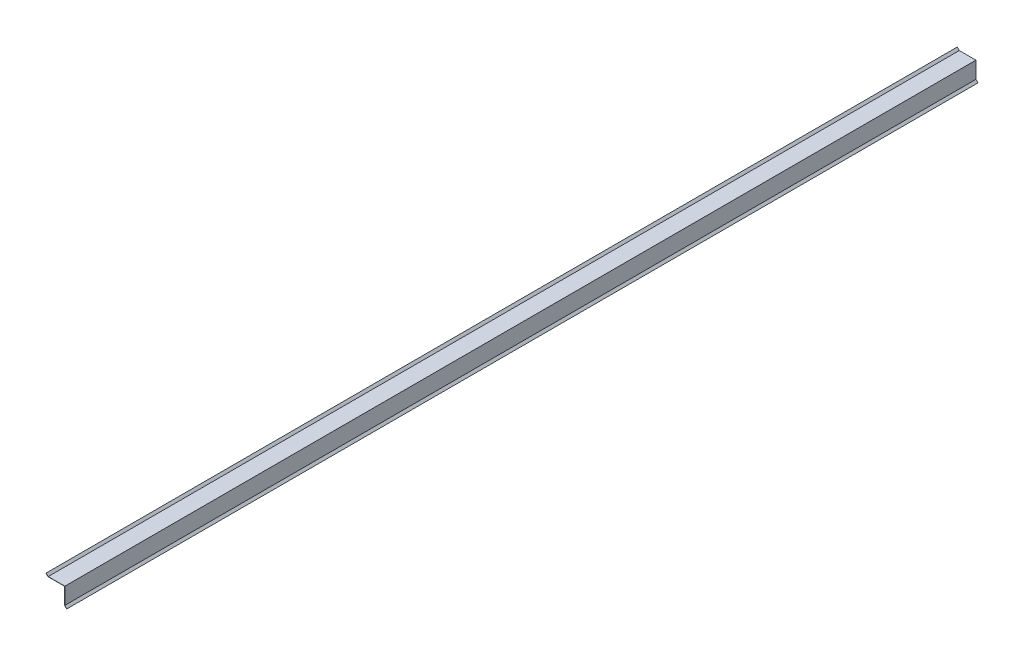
ISO-10303-21;
HEADER;
FILE_DESCRIPTION(('STEP AP214'),'2;1');
FILE_NAME('part.step','',(''),(''),'','','');
FILE_SCHEMA(('AUTOMOTIVE_DESIGN { 1 0 10303 214 1 1 1 1 }'));
ENDSEC;
DATA;
#1=APPLICATION_CONTEXT('core data for automotive mechanical design processes');
#2=APPLICATION_PROTOCOL_DEFINITION('international standard','automotive_design',2000,#1);
#3=PRODUCT_CONTEXT('',#1,'mechanical');
#4=PRODUCT('Part','Part','',(#3));
#5=PRODUCT_RELATED_PRODUCT_CATEGORY('part','',(#4));
#6=PRODUCT_DEFINITION_FORMATION('','',#4);
#7=PRODUCT_DEFINITION_CONTEXT('part definition',#1,'design');
#8=PRODUCT_DEFINITION('design','',#6,#7);
#9=PRODUCT_DEFINITION_SHAPE('','',#8);
#10=(LENGTH_UNIT() NAMED_UNIT(*) SI_UNIT(.MILLI.,.METRE.));
#11=(NAMED_UNIT(*) PLANE_ANGLE_UNIT() SI_UNIT($,.RADIAN.));
#12=(NAMED_UNIT(*) SI_UNIT($,.STERADIAN.) SOLID_ANGLE_UNIT());
#13=UNCERTAINTY_MEASURE_WITH_UNIT(LENGTH_MEASURE(1.E-05),#10,'distance_accuracy_value','');
#14=(GEOMETRIC_REPRESENTATION_CONTEXT(3) GLOBAL_UNCERTAINTY_ASSIGNED_CONTEXT((#13)) GLOBAL_UNIT_ASSIGNED_CONTEXT((#10,
#11,#12)) REPRESENTATION_CONTEXT('',''));
#15=CARTESIAN_POINT('',(0.,0.,0.));
#16=DIRECTION('',(0.,0.,1.));
#17=DIRECTION('',(1.,0.,0.));
#18=AXIS2_PLACEMENT_3D('',#15,#16,#17);
#19=CARTESIAN_POINT('',(-36.5125,0.,2000.));
#20=DIRECTION('',(-0.707106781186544,-0.707106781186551,0.));
#21=DIRECTION('',(0.707106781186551,-0.707106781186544,0.));
#22=AXIS2_PLACEMENT_3D('',#19,#20,#21);
#23=PLANE('',#22);
#24=DIRECTION('',(-0.707106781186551,0.707106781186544,0.));
#25=VECTOR('',#24,1.);
#26=CARTESIAN_POINT('',(-36.5125,0.,0.));
#27=LINE('',#26,#25);
#28=CARTESIAN_POINT('',(-36.5125,0.,0.));
#29=VERTEX_POINT('',#28);
#30=CARTESIAN_POINT('',(-41.0026280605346,4.49012806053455,0.));
#31=VERTEX_POINT('',#30);
#32=EDGE_CURVE('E144',#29,#31,#27,.T.);
#33=ORIENTED_EDGE('',*,*,#32,.T.);
#34=DIRECTION('',(0.,0.,-1.));
#35=VECTOR('',#34,1.);
#36=CARTESIAN_POINT('',(-41.0026280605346,4.49012806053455,2000.));
#37=LINE('',#36,#35);
#38=CARTESIAN_POINT('',(-41.0026280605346,4.49012806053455,2000.));
#39=VERTEX_POINT('',#38);
#40=EDGE_CURVE('E11',#39,#31,#37,.T.);
#41=ORIENTED_EDGE('',*,*,#40,.F.);
#42=DIRECTION('',(-0.707106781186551,0.707106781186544,0.));
#43=VECTOR('',#42,1.);
#44=CARTESIAN_POINT('',(-36.5125,0.,2000.));
#45=LINE('',#44,#43);
#46=CARTESIAN_POINT('',(-36.5125,0.,2000.));
#47=VERTEX_POINT('',#46);
#48=EDGE_CURVE('E99',#47,#39,#45,.T.);
#49=ORIENTED_EDGE('',*,*,#48,.F.);
#50=DIRECTION('',(0.,0.,-1.));
#51=VECTOR('',#50,1.);
#52=CARTESIAN_POINT('',(-36.5125,0.,2000.));
#53=LINE('',#52,#51);
#54=EDGE_CURVE('E140',#47,#29,#53,.T.);
#55=ORIENTED_EDGE('',*,*,#54,.T.);
#56=EDGE_LOOP('',(#33,#41,#49,#55));
#57=FACE_BOUND('',#56,.T.);
#58=ADVANCED_FACE('F37',(#57),#23,.F.);
#59=CARTESIAN_POINT('',(-41.3618383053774,4.13091781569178,2000.));
#60=DIRECTION('',(-0.707106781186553,0.707106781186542,0.));
#61=DIRECTION('',(-0.707106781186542,-0.707106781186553,0.));
#62=AXIS2_PLACEMENT_3D('',#59,#60,#61);
#63=PLANE('',#62);
#64=DIRECTION('',(0.707106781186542,0.707106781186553,0.));
#65=VECTOR('',#64,1.);
#66=CARTESIAN_POINT('',(-41.3618383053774,4.13091781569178,0.));
#67=LINE('',#66,#65);
#68=CARTESIAN_POINT('',(-41.3618383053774,4.13091781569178,0.));
#69=VERTEX_POINT('',#68);
#70=EDGE_CURVE('E147',#69,#31,#67,.T.);
#71=ORIENTED_EDGE('',*,*,#70,.F.);
#72=DIRECTION('',(0.,0.,-1.));
#73=VECTOR('',#72,1.);
#74=CARTESIAN_POINT('',(-41.3618383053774,4.13091781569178,2000.));
#75=LINE('',#74,#73);
#76=CARTESIAN_POINT('',(-41.3618383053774,4.13091781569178,2000.));
#77=VERTEX_POINT('',#76);
#78=EDGE_CURVE('E45',#77,#69,#75,.T.);
#79=ORIENTED_EDGE('',*,*,#78,.F.);
#80=DIRECTION('',(0.707106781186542,0.707106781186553,0.));
#81=VECTOR('',#80,1.);
#82=CARTESIAN_POINT('',(-41.3618383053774,4.13091781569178,2000.));
#83=LINE('',#82,#81);
#84=EDGE_CURVE('E200',#77,#39,#83,.T.);
#85=ORIENTED_EDGE('',*,*,#84,.T.);
#86=ORIENTED_EDGE('',*,*,#40,.T.);
#87=EDGE_LOOP('',(#71,#79,#85,#86));
#88=FACE_BOUND('',#87,.T.);
#89=ADVANCED_FACE('F187',(#88),#63,.T.);
#90=CARTESIAN_POINT('',(-36.8717102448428,-0.359210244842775,2000.));
#91=DIRECTION('',(-0.707106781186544,-0.707106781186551,0.));
#92=DIRECTION('',(0.707106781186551,-0.707106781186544,0.));
#93=AXIS2_PLACEMENT_3D('',#90,#91,#92);
#94=PLANE('',#93);
#95=DIRECTION('',(-0.707106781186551,0.707106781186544,0.));
#96=VECTOR('',#95,1.);
#97=CARTESIAN_POINT('',(-36.8717102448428,-0.359210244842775,0.));
#98=LINE('',#97,#96);
#99=CARTESIAN_POINT('',(-36.7229204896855,-0.508000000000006,0.));
#100=VERTEX_POINT('',#99);
#101=EDGE_CURVE('E150',#100,#69,#98,.T.);
#102=ORIENTED_EDGE('',*,*,#101,.F.);
#103=DIRECTION('',(0.,0.,-1.));
#104=VECTOR('',#103,1.);
#105=CARTESIAN_POINT('',(-36.7229204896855,-0.508000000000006,2000.));
#106=LINE('',#105,#104);
#107=CARTESIAN_POINT('',(-36.7229204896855,-0.508000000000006,2000.));
#108=VERTEX_POINT('',#107);
#109=EDGE_CURVE('E177',#108,#100,#106,.T.);
#110=ORIENTED_EDGE('',*,*,#109,.F.);
#111=DIRECTION('',(-0.707106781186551,0.707106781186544,0.));
#112=VECTOR('',#111,1.);
#113=CARTESIAN_POINT('',(-36.8717102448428,-0.359210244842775,2000.));
#114=LINE('',#113,#112);
#115=EDGE_CURVE('E184',#108,#77,#114,.T.);
#116=ORIENTED_EDGE('',*,*,#115,.T.);
#117=ORIENTED_EDGE('',*,*,#78,.T.);
#118=EDGE_LOOP('',(#102,#110,#116,#117));
#119=FACE_BOUND('',#118,.T.);
#120=ADVANCED_FACE('F182',(#119),#94,.T.);
#121=CARTESIAN_POINT('',(-36.5125,-0.508000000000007,2000.));
#122=DIRECTION('',(0.,-1.,0.));
#123=DIRECTION('',(1.,0.,0.));
#124=AXIS2_PLACEMENT_3D('',#121,#122,#123);
#125=PLANE('',#124);
#126=DIRECTION('',(-1.,0.,0.));
#127=VECTOR('',#126,1.);
#128=CARTESIAN_POINT('',(-36.5125,-0.508000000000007,0.));
#129=LINE('',#128,#127);
#130=CARTESIAN_POINT('',(-0.508000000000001,-0.508000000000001,0.));
#131=VERTEX_POINT('',#130);
#132=EDGE_CURVE('E153',#131,#100,#129,.T.);
#133=ORIENTED_EDGE('',*,*,#132,.F.);
#134=DIRECTION('',(0.,0.,-1.));
#135=VECTOR('',#134,1.);
#136=CARTESIAN_POINT('',(-0.508000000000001,-0.508000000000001,2000.));
#137=LINE('',#136,#135);
#138=CARTESIAN_POINT('',(-0.508000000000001,-0.508000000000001,2000.));
#139=VERTEX_POINT('',#138);
#140=EDGE_CURVE('E175',#139,#131,#137,.T.);
#141=ORIENTED_EDGE('',*,*,#140,.F.);
#142=DIRECTION('',(-1.,0.,0.));
#143=VECTOR('',#142,1.);
#144=CARTESIAN_POINT('',(-36.5125,-0.508000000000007,2000.));
#145=LINE('',#144,#143);
#146=EDGE_CURVE('E197',#139,#108,#145,.T.);
#147=ORIENTED_EDGE('',*,*,#146,.T.);
#148=ORIENTED_EDGE('',*,*,#109,.T.);
#149=EDGE_LOOP('',(#133,#141,#147,#148));
#150=FACE_BOUND('',#149,.T.);
#151=ADVANCED_FACE('F194',(#150),#125,.T.);
#152=CARTESIAN_POINT('',(-0.508,-36.5125,2000.));
#153=DIRECTION('',(-1.,0.,0.));
#154=DIRECTION('',(0.,0.,1.));
#155=AXIS2_PLACEMENT_3D('',#152,#153,#154);
#156=PLANE('',#155);
#157=DIRECTION('',(0.,1.,0.));
#158=VECTOR('',#157,1.);
#159=CARTESIAN_POINT('',(-0.508,-36.5125,0.));
#160=LINE('',#159,#158);
#161=CARTESIAN_POINT('',(-0.508,-36.7229204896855,0.));
#162=VERTEX_POINT('',#161);
#163=EDGE_CURVE('E156',#162,#131,#160,.T.);
#164=ORIENTED_EDGE('',*,*,#163,.F.);
#165=DIRECTION('',(0.,0.,-1.));
#166=VECTOR('',#165,1.);
#167=CARTESIAN_POINT('',(-0.508,-36.7229204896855,2000.));
#168=LINE('',#167,#166);
#169=CARTESIAN_POINT('',(-0.508,-36.7229204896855,2000.));
#170=VERTEX_POINT('',#169);
#171=EDGE_CURVE('E173',#170,#162,#168,.T.);
#172=ORIENTED_EDGE('',*,*,#171,.F.);
#173=DIRECTION('',(0.,1.,0.));
#174=VECTOR('',#173,1.);
#175=CARTESIAN_POINT('',(-0.508,-36.5125,2000.));
#176=LINE('',#175,#174);
#177=EDGE_CURVE('E202',#170,#139,#176,.T.);
#178=ORIENTED_EDGE('',*,*,#177,.T.);
#179=ORIENTED_EDGE('',*,*,#140,.T.);
#180=EDGE_LOOP('',(#164,#172,#178,#179));
#181=FACE_BOUND('',#180,.T.);
#182=ADVANCED_FACE('F236',(#181),#156,.T.);
#183=CARTESIAN_POINT('',(-0.359210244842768,-36.8717102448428,2000.));
#184=DIRECTION('',(-0.707106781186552,-0.707106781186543,0.));
#185=DIRECTION('',(0.707106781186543,-0.707106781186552,0.));
#186=AXIS2_PLACEMENT_3D('',#183,#184,#185);
#187=PLANE('',#186);
#188=DIRECTION('',(-0.707106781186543,0.707106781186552,0.));
#189=VECTOR('',#188,1.);
#190=CARTESIAN_POINT('',(-0.359210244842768,-36.8717102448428,0.));
#191=LINE('',#190,#189);
#192=CARTESIAN_POINT('',(4.13091781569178,-41.3618383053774,0.));
#193=VERTEX_POINT('',#192);
#194=EDGE_CURVE('E159',#193,#162,#191,.T.);
#195=ORIENTED_EDGE('',*,*,#194,.F.);
#196=DIRECTION('',(0.,0.,-1.));
#197=VECTOR('',#196,1.);
#198=CARTESIAN_POINT('',(4.13091781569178,-41.3618383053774,2000.));
#199=LINE('',#198,#197);
#200=CARTESIAN_POINT('',(4.13091781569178,-41.3618383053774,2000.));
#201=VERTEX_POINT('',#200);
#202=EDGE_CURVE('E171',#201,#193,#199,.T.);
#203=ORIENTED_EDGE('',*,*,#202,.F.);
#204=DIRECTION('',(-0.707106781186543,0.707106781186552,0.));
#205=VECTOR('',#204,1.);
#206=CARTESIAN_POINT('',(-0.359210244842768,-36.8717102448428,2000.));
#207=LINE('',#206,#205);
#208=EDGE_CURVE('E208',#201,#170,#207,.T.);
#209=ORIENTED_EDGE('',*,*,#208,.T.);
#210=ORIENTED_EDGE('',*,*,#171,.T.);
#211=EDGE_LOOP('',(#195,#203,#209,#210));
#212=FACE_BOUND('',#211,.T.);
#213=ADVANCED_FACE('F239',(#212),#187,.T.);
#214=CARTESIAN_POINT('',(4.49012806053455,-41.0026280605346,2000.));
#215=DIRECTION('',(0.707106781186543,-0.707106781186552,0.));
#216=DIRECTION('',(0.707106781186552,0.707106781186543,0.));
#217=AXIS2_PLACEMENT_3D('',#214,#215,#216);
#218=PLANE('',#217);
#219=DIRECTION('',(-0.707106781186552,-0.707106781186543,0.));
#220=VECTOR('',#219,1.);
#221=CARTESIAN_POINT('',(4.49012806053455,-41.0026280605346,0.));
#222=LINE('',#221,#220);
#223=CARTESIAN_POINT('',(4.49012806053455,-41.0026280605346,0.));
#224=VERTEX_POINT('',#223);
#225=EDGE_CURVE('E162',#224,#193,#222,.T.);
#226=ORIENTED_EDGE('',*,*,#225,.F.);
#227=DIRECTION('',(0.,0.,-1.));
#228=VECTOR('',#227,1.);
#229=CARTESIAN_POINT('',(4.49012806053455,-41.0026280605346,2000.));
#230=LINE('',#229,#228);
#231=CARTESIAN_POINT('',(4.49012806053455,-41.0026280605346,2000.));
#232=VERTEX_POINT('',#231);
#233=EDGE_CURVE('E135',#232,#224,#230,.T.);
#234=ORIENTED_EDGE('',*,*,#233,.F.);
#235=DIRECTION('',(-0.707106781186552,-0.707106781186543,0.));
#236=VECTOR('',#235,1.);
#237=CARTESIAN_POINT('',(4.49012806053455,-41.0026280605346,2000.));
#238=LINE('',#237,#236);
#239=EDGE_CURVE('E128',#232,#201,#238,.T.);
#240=ORIENTED_EDGE('',*,*,#239,.T.);
#241=ORIENTED_EDGE('',*,*,#202,.T.);
#242=EDGE_LOOP('',(#226,#234,#240,#241));
#243=FACE_BOUND('',#242,.T.);
#244=ADVANCED_FACE('F212',(#243),#218,.T.);
#245=CARTESIAN_POINT('',(0.,-36.5125,2000.));
#246=DIRECTION('',(-0.707106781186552,-0.707106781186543,0.));
#247=DIRECTION('',(0.707106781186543,-0.707106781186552,0.));
#248=AXIS2_PLACEMENT_3D('',#245,#246,#247);
#249=PLANE('',#248);
#250=DIRECTION('',(-0.707106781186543,0.707106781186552,0.));
#251=VECTOR('',#250,1.);
#252=CARTESIAN_POINT('',(0.,-36.5125,0.));
#253=LINE('',#252,#251);
#254=CARTESIAN_POINT('',(0.,-36.5125,0.));
#255=VERTEX_POINT('',#254);
#256=EDGE_CURVE('E134',#224,#255,#253,.T.);
#257=ORIENTED_EDGE('',*,*,#256,.T.);
#258=DIRECTION('',(0.,0.,-1.));
#259=VECTOR('',#258,1.);
#260=CARTESIAN_POINT('',(0.,-36.5125,2000.));
#261=LINE('',#260,#259);
#262=CARTESIAN_POINT('',(0.,-36.5125,2000.));
#263=VERTEX_POINT('',#262);
#264=EDGE_CURVE('E131',#263,#255,#261,.T.);
#265=ORIENTED_EDGE('',*,*,#264,.F.);
#266=DIRECTION('',(-0.707106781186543,0.707106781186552,0.));
#267=VECTOR('',#266,1.);
#268=CARTESIAN_POINT('',(0.,-36.5125,2000.));
#269=LINE('',#268,#267);
#270=EDGE_CURVE('E121',#232,#263,#269,.T.);
#271=ORIENTED_EDGE('',*,*,#270,.F.);
#272=ORIENTED_EDGE('',*,*,#233,.T.);
#273=EDGE_LOOP('',(#257,#265,#271,#272));
#274=FACE_BOUND('',#273,.T.);
#275=ADVANCED_FACE('F132',(#274),#249,.F.);
#276=CARTESIAN_POINT('',(0.,-36.5125,2000.));
#277=DIRECTION('',(-1.,0.,0.));
#278=DIRECTION('',(0.,0.,1.));
#279=AXIS2_PLACEMENT_3D('',#276,#277,#278);
#280=PLANE('',#279);
#281=DIRECTION('',(0.,1.,0.));
#282=VECTOR('',#281,1.);
#283=CARTESIAN_POINT('',(0.,-36.5125,0.));
#284=LINE('',#283,#282);
#285=CARTESIAN_POINT('',(0.,0.,0.));
#286=VERTEX_POINT('',#285);
#287=EDGE_CURVE('E87',#255,#286,#284,.T.);
#288=ORIENTED_EDGE('',*,*,#287,.T.);
#289=DIRECTION('',(0.,0.,-1.));
#290=VECTOR('',#289,1.);
#291=CARTESIAN_POINT('',(0.,0.,2000.));
#292=LINE('',#291,#290);
#293=CARTESIAN_POINT('',(0.,0.,2000.));
#294=VERTEX_POINT('',#293);
#295=EDGE_CURVE('E136',#294,#286,#292,.T.);
#296=ORIENTED_EDGE('',*,*,#295,.F.);
#297=DIRECTION('',(0.,1.,0.));
#298=VECTOR('',#297,1.);
#299=CARTESIAN_POINT('',(0.,-36.5125,2000.));
#300=LINE('',#299,#298);
#301=EDGE_CURVE('E125',#263,#294,#300,.T.);
#302=ORIENTED_EDGE('',*,*,#301,.F.);
#303=ORIENTED_EDGE('',*,*,#264,.T.);
#304=EDGE_LOOP('',(#288,#296,#302,#303));
#305=FACE_BOUND('',#304,.T.);
#306=ADVANCED_FACE('F138',(#305),#280,.F.);
#307=CARTESIAN_POINT('',(-36.5125,0.,2000.));
#308=DIRECTION('',(0.,-1.,0.));
#309=DIRECTION('',(1.,0.,0.));
#310=AXIS2_PLACEMENT_3D('',#307,#308,#309);
#311=PLANE('',#310);
#312=DIRECTION('',(-1.,0.,0.));
#313=VECTOR('',#312,1.);
#314=CARTESIAN_POINT('',(-36.5125,0.,0.));
#315=LINE('',#314,#313);
#316=EDGE_CURVE('E93',#286,#29,#315,.T.);
#317=ORIENTED_EDGE('',*,*,#316,.T.);
#318=ORIENTED_EDGE('',*,*,#54,.F.);
#319=DIRECTION('',(-1.,0.,0.));
#320=VECTOR('',#319,1.);
#321=CARTESIAN_POINT('',(-36.5125,0.,2000.));
#322=LINE('',#321,#320);
#323=EDGE_CURVE('E53',#294,#47,#322,.T.);
#324=ORIENTED_EDGE('',*,*,#323,.F.);
#325=ORIENTED_EDGE('',*,*,#295,.T.);
#326=EDGE_LOOP('',(#317,#318,#324,#325));
#327=FACE_BOUND('',#326,.T.);
#328=ADVANCED_FACE('F215',(#327),#311,.F.);
#329=CARTESIAN_POINT('',(0.,0.,2000.));
#330=DIRECTION('',(0.,0.,-1.));
#331=DIRECTION('',(-1.,0.,0.));
#332=AXIS2_PLACEMENT_3D('',#329,#330,#331);
#333=PLANE('',#332);
#334=ORIENTED_EDGE('',*,*,#48,.T.);
#335=ORIENTED_EDGE('',*,*,#84,.F.);
#336=ORIENTED_EDGE('',*,*,#115,.F.);
#337=ORIENTED_EDGE('',*,*,#146,.F.);
#338=ORIENTED_EDGE('',*,*,#177,.F.);
#339=ORIENTED_EDGE('',*,*,#208,.F.);
#340=ORIENTED_EDGE('',*,*,#239,.F.);
#341=ORIENTED_EDGE('',*,*,#270,.T.);
#342=ORIENTED_EDGE('',*,*,#301,.T.);
#343=ORIENTED_EDGE('',*,*,#323,.T.);
#344=EDGE_LOOP('',(#334,#335,#336,#337,#338,#339,#340,#341,#342,#343));
#345=FACE_BOUND('',#344,.T.);
#346=ADVANCED_FACE('F123',(#345),#333,.F.);
#347=CARTESIAN_POINT('',(0.,0.,0.));
#348=DIRECTION('',(0.,0.,-1.));
#349=DIRECTION('',(-1.,0.,0.));
#350=AXIS2_PLACEMENT_3D('',#347,#348,#349);
#351=PLANE('',#350);
#352=ORIENTED_EDGE('',*,*,#32,.F.);
#353=ORIENTED_EDGE('',*,*,#316,.F.);
#354=ORIENTED_EDGE('',*,*,#287,.F.);
#355=ORIENTED_EDGE('',*,*,#256,.F.);
#356=ORIENTED_EDGE('',*,*,#225,.T.);
#357=ORIENTED_EDGE('',*,*,#194,.T.);
#358=ORIENTED_EDGE('',*,*,#163,.T.);
#359=ORIENTED_EDGE('',*,*,#132,.T.);
#360=ORIENTED_EDGE('',*,*,#101,.T.);
#361=ORIENTED_EDGE('',*,*,#70,.T.);
#362=EDGE_LOOP('',(#352,#353,#354,#355,#356,#357,#358,#359,#360,#361));
#363=FACE_BOUND('',#362,.T.);
#364=ADVANCED_FACE('F190',(#363),#351,.T.);
#365=CLOSED_SHELL('',(#58,#89,#120,#151,#182,#213,#244,#275,#306,#328,#346,#364));
#366=MANIFOLD_SOLID_BREP('B2',#365);
#367=ADVANCED_BREP_SHAPE_REPRESENTATION('',(#18,#366),#14);
#368=SHAPE_DEFINITION_REPRESENTATION(#9,#367);
ENDSEC;
END-ISO-10303-21;
